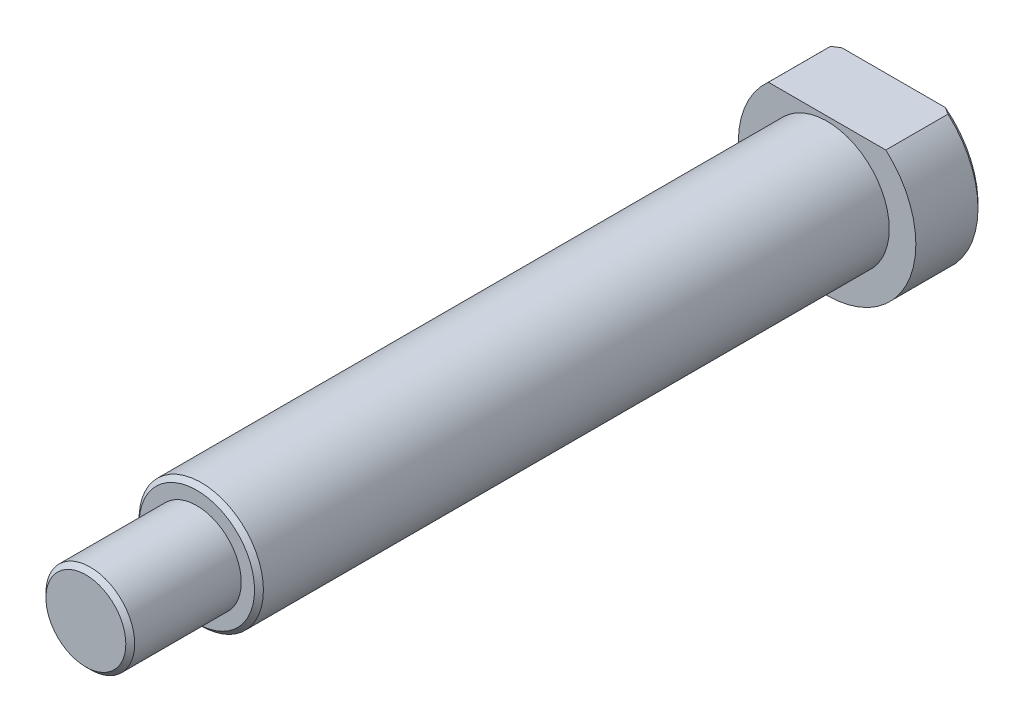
ISO-10303-21;
HEADER;
FILE_DESCRIPTION(('STEP AP214'),'2;1');
FILE_NAME('part.step','',(''),(''),'','','');
FILE_SCHEMA(('AUTOMOTIVE_DESIGN { 1 0 10303 214 1 1 1 1 }'));
ENDSEC;
DATA;
#1=APPLICATION_CONTEXT('core data for automotive mechanical design processes');
#2=APPLICATION_PROTOCOL_DEFINITION('international standard','automotive_design',2000,#1);
#3=PRODUCT_CONTEXT('',#1,'mechanical');
#4=PRODUCT('Part','Part','',(#3));
#5=PRODUCT_RELATED_PRODUCT_CATEGORY('part','',(#4));
#6=PRODUCT_DEFINITION_FORMATION('','',#4);
#7=PRODUCT_DEFINITION_CONTEXT('part definition',#1,'design');
#8=PRODUCT_DEFINITION('design','',#6,#7);
#9=PRODUCT_DEFINITION_SHAPE('','',#8);
#10=(LENGTH_UNIT() NAMED_UNIT(*) SI_UNIT(.MILLI.,.METRE.));
#11=(NAMED_UNIT(*) PLANE_ANGLE_UNIT() SI_UNIT($,.RADIAN.));
#12=(NAMED_UNIT(*) SI_UNIT($,.STERADIAN.) SOLID_ANGLE_UNIT());
#13=UNCERTAINTY_MEASURE_WITH_UNIT(LENGTH_MEASURE(1.E-05),#10,'distance_accuracy_value','');
#14=(GEOMETRIC_REPRESENTATION_CONTEXT(3) GLOBAL_UNCERTAINTY_ASSIGNED_CONTEXT((#13)) GLOBAL_UNIT_ASSIGNED_CONTEXT((#10,
#11,#12)) REPRESENTATION_CONTEXT('',''));
#15=CARTESIAN_POINT('',(0.,0.,0.));
#16=DIRECTION('',(0.,0.,1.));
#17=DIRECTION('',(1.,0.,0.));
#18=AXIS2_PLACEMENT_3D('',#15,#16,#17);
#19=CARTESIAN_POINT('',(0.,0.,157.));
#20=DIRECTION('',(0.,0.,1.));
#21=DIRECTION('',(1.,0.,0.));
#22=AXIS2_PLACEMENT_3D('',#19,#20,#21);
#23=PLANE('',#22);
#24=CARTESIAN_POINT('',(0.,0.,157.));
#25=DIRECTION('',(0.,0.,1.));
#26=DIRECTION('',(1.,0.,0.));
#27=AXIS2_PLACEMENT_3D('',#24,#25,#26);
#28=CIRCLE('',#27,13.);
#29=CARTESIAN_POINT('',(13.,0.,157.));
#30=VERTEX_POINT('',#29);
#31=EDGE_CURVE('E79',#30,#30,#28,.T.);
#32=ORIENTED_EDGE('',*,*,#31,.T.);
#33=EDGE_LOOP('',(#32));
#34=FACE_BOUND('',#33,.T.);
#35=CARTESIAN_POINT('',(0.,0.,157.));
#36=DIRECTION('',(0.,0.,1.));
#37=DIRECTION('',(1.,0.,0.));
#38=AXIS2_PLACEMENT_3D('',#35,#36,#37);
#39=CIRCLE('',#38,10.);
#40=CARTESIAN_POINT('',(10.,0.,157.));
#41=VERTEX_POINT('',#40);
#42=EDGE_CURVE('E146',#41,#41,#39,.T.);
#43=ORIENTED_EDGE('',*,*,#42,.F.);
#44=EDGE_LOOP('',(#43));
#45=FACE_BOUND('',#44,.T.);
#46=ADVANCED_FACE('F30',(#34,#45),#23,.T.);
#47=CARTESIAN_POINT('',(0.,0.,15.));
#48=DIRECTION('',(0.,0.,1.));
#49=DIRECTION('',(1.,0.,0.));
#50=AXIS2_PLACEMENT_3D('',#47,#48,#49);
#51=PLANE('',#50);
#52=CARTESIAN_POINT('',(0.,0.,15.));
#53=DIRECTION('',(0.,0.,1.));
#54=DIRECTION('',(1.,0.,0.));
#55=AXIS2_PLACEMENT_3D('',#52,#53,#54);
#56=CIRCLE('',#55,20.);
#57=CARTESIAN_POINT('',(-13.228756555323,15.,15.));
#58=VERTEX_POINT('',#57);
#59=CARTESIAN_POINT('',(13.228756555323,15.,15.));
#60=VERTEX_POINT('',#59);
#61=EDGE_CURVE('E69',#58,#60,#56,.T.);
#62=ORIENTED_EDGE('',*,*,#61,.T.);
#63=DIRECTION('',(-1.,0.,0.));
#64=VECTOR('',#63,1.);
#65=CARTESIAN_POINT('',(-13.228756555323,15.,15.));
#66=LINE('',#65,#64);
#67=EDGE_CURVE('E60',#60,#58,#66,.T.);
#68=ORIENTED_EDGE('',*,*,#67,.T.);
#69=EDGE_LOOP('',(#62,#68));
#70=FACE_BOUND('',#69,.T.);
#71=CARTESIAN_POINT('',(0.,0.,15.));
#72=DIRECTION('',(0.,0.,1.));
#73=DIRECTION('',(1.,0.,0.));
#74=AXIS2_PLACEMENT_3D('',#71,#72,#73);
#75=CIRCLE('',#74,14.);
#76=CARTESIAN_POINT('',(14.,0.,15.));
#77=VERTEX_POINT('',#76);
#78=EDGE_CURVE('E148',#77,#77,#75,.T.);
#79=ORIENTED_EDGE('',*,*,#78,.F.);
#80=EDGE_LOOP('',(#79));
#81=FACE_BOUND('',#80,.T.);
#82=ADVANCED_FACE('F71',(#70,#81),#51,.T.);
#83=CARTESIAN_POINT('',(0.,0.,15.));
#84=DIRECTION('',(0.,0.,-1.));
#85=DIRECTION('',(-1.,0.,0.));
#86=AXIS2_PLACEMENT_3D('',#83,#84,#85);
#87=CYLINDRICAL_SURFACE('',#86,20.);
#88=DIRECTION('',(0.,0.,-1.));
#89=VECTOR('',#88,1.);
#90=CARTESIAN_POINT('',(-13.228756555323,15.,15.));
#91=LINE('',#90,#89);
#92=CARTESIAN_POINT('',(-13.228756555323,15.,1.));
#93=VERTEX_POINT('',#92);
#94=EDGE_CURVE('E66',#58,#93,#91,.T.);
#95=ORIENTED_EDGE('',*,*,#94,.T.);
#96=CARTESIAN_POINT('',(0.,0.,1.));
#97=DIRECTION('',(0.,0.,1.));
#98=DIRECTION('',(1.,0.,0.));
#99=AXIS2_PLACEMENT_3D('',#96,#97,#98);
#100=CIRCLE('',#99,20.);
#101=CARTESIAN_POINT('',(13.228756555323,15.,1.));
#102=VERTEX_POINT('',#101);
#103=EDGE_CURVE('E78',#93,#102,#100,.T.);
#104=ORIENTED_EDGE('',*,*,#103,.T.);
#105=DIRECTION('',(0.,0.,-1.));
#106=VECTOR('',#105,1.);
#107=CARTESIAN_POINT('',(13.228756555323,15.,15.));
#108=LINE('',#107,#106);
#109=EDGE_CURVE('E64',#60,#102,#108,.T.);
#110=ORIENTED_EDGE('',*,*,#109,.F.);
#111=ORIENTED_EDGE('',*,*,#61,.F.);
#112=EDGE_LOOP('',(#95,#104,#110,#111));
#113=FACE_BOUND('',#112,.T.);
#114=ADVANCED_FACE('F32',(#113),#87,.T.);
#115=CARTESIAN_POINT('',(-13.228756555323,15.,15.));
#116=DIRECTION('',(0.,-1.,0.));
#117=DIRECTION('',(0.,0.,-1.));
#118=AXIS2_PLACEMENT_3D('',#115,#116,#117);
#119=PLANE('',#118);
#120=ORIENTED_EDGE('',*,*,#109,.T.);
#121=CARTESIAN_POINT('',(13.228756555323,15.,1.));
#122=CARTESIAN_POINT('',(13.0995525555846,15.,0.914540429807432));
#123=CARTESIAN_POINT('',(12.9700248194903,15.,0.829569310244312));
#124=CARTESIAN_POINT('',(12.7103026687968,15.,0.660672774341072));
#125=CARTESIAN_POINT('',(12.5801083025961,15.,0.576747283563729));
#126=CARTESIAN_POINT('',(12.3190144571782,15.,0.409998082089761));
#127=CARTESIAN_POINT('',(12.1881149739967,15.,0.327174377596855));
#128=CARTESIAN_POINT('',(11.9255723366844,15.,0.162693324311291));
#129=CARTESIAN_POINT('',(11.7939291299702,15.,0.0810360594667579));
#130=CARTESIAN_POINT('',(11.6619037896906,15.,0.));
#131=B_SPLINE_CURVE_WITH_KNOTS('',3,(#121,#122,#123,#124,#125,#126,#127,#128,#129,#130),
.UNSPECIFIED.,.F.,.F.,(4,2,2,2,4),(0.,0.464728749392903,0.929424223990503,1.39412231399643,
1.85885368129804),.UNSPECIFIED.);
#132=CARTESIAN_POINT('',(11.6619037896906,15.,0.));
#133=VERTEX_POINT('',#132);
#134=EDGE_CURVE('E38',#102,#133,#131,.T.);
#135=ORIENTED_EDGE('',*,*,#134,.T.);
#136=DIRECTION('',(-1.,0.,0.));
#137=VECTOR('',#136,1.);
#138=CARTESIAN_POINT('',(-13.228756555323,15.,0.));
#139=LINE('',#138,#137);
#140=CARTESIAN_POINT('',(-11.6619037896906,15.,0.));
#141=VERTEX_POINT('',#140);
#142=EDGE_CURVE('E74',#133,#141,#139,.T.);
#143=ORIENTED_EDGE('',*,*,#142,.T.);
#144=CARTESIAN_POINT('',(-11.6619037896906,15.,0.));
#145=CARTESIAN_POINT('',(-11.7939291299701,15.,0.0810360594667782));
#146=CARTESIAN_POINT('',(-11.9255723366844,15.,0.162693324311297));
#147=CARTESIAN_POINT('',(-12.1881149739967,15.,0.327174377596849));
#148=CARTESIAN_POINT('',(-12.3190144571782,15.,0.409998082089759));
#149=CARTESIAN_POINT('',(-12.580108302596,15.,0.576747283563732));
#150=CARTESIAN_POINT('',(-12.7103026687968,15.,0.660672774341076));
#151=CARTESIAN_POINT('',(-12.9700248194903,15.,0.829569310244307));
#152=CARTESIAN_POINT('',(-13.0995525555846,15.,0.914540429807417));
#153=CARTESIAN_POINT('',(-13.228756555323,15.,0.999999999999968));
#154=B_SPLINE_CURVE_WITH_KNOTS('',3,(#144,#145,#146,#147,#148,#149,#150,#151,#152,#153),
.UNSPECIFIED.,.F.,.F.,(4,2,2,2,4),(0.,0.464731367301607,0.929429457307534,1.39412493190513,
1.85885368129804),.UNSPECIFIED.);
#155=EDGE_CURVE('E95',#141,#93,#154,.T.);
#156=ORIENTED_EDGE('',*,*,#155,.T.);
#157=ORIENTED_EDGE('',*,*,#94,.F.);
#158=ORIENTED_EDGE('',*,*,#67,.F.);
#159=EDGE_LOOP('',(#120,#135,#143,#156,#157,#158));
#160=FACE_BOUND('',#159,.T.);
#161=ADVANCED_FACE('F62',(#160),#119,.F.);
#162=CARTESIAN_POINT('',(0.,0.,0.));
#163=DIRECTION('',(0.,0.,1.));
#164=DIRECTION('',(1.,0.,0.));
#165=AXIS2_PLACEMENT_3D('',#162,#163,#164);
#166=PLANE('',#165);
#167=ORIENTED_EDGE('',*,*,#142,.F.);
#168=CARTESIAN_POINT('',(0.,0.,0.));
#169=DIRECTION('',(0.,0.,1.));
#170=DIRECTION('',(1.,0.,0.));
#171=AXIS2_PLACEMENT_3D('',#168,#169,#170);
#172=CIRCLE('',#171,19.);
#173=EDGE_CURVE('E11',#133,#141,#172,.F.);
#174=ORIENTED_EDGE('',*,*,#173,.T.);
#175=EDGE_LOOP('',(#167,#174));
#176=FACE_BOUND('',#175,.T.);
#177=ADVANCED_FACE('F109',(#176),#166,.F.);
#178=CARTESIAN_POINT('',(0.,0.,157.));
#179=DIRECTION('',(0.,0.,-1.));
#180=DIRECTION('',(-1.,0.,0.));
#181=AXIS2_PLACEMENT_3D('',#178,#179,#180);
#182=CYLINDRICAL_SURFACE('',#181,14.);
#183=CARTESIAN_POINT('',(0.,0.,156.));
#184=DIRECTION('',(0.,0.,1.));
#185=DIRECTION('',(1.,0.,0.));
#186=AXIS2_PLACEMENT_3D('',#183,#184,#185);
#187=CIRCLE('',#186,14.);
#188=CARTESIAN_POINT('',(14.,0.,156.));
#189=VERTEX_POINT('',#188);
#190=EDGE_CURVE('E82',#189,#189,#187,.F.);
#191=ORIENTED_EDGE('',*,*,#190,.T.);
#192=EDGE_LOOP('',(#191));
#193=FACE_BOUND('',#192,.T.);
#194=ORIENTED_EDGE('',*,*,#78,.T.);
#195=EDGE_LOOP('',(#194));
#196=FACE_BOUND('',#195,.T.);
#197=ADVANCED_FACE('F115',(#193,#196),#182,.T.);
#198=CARTESIAN_POINT('',(0.,0.,182.));
#199=DIRECTION('',(0.,0.,-1.));
#200=DIRECTION('',(-1.,0.,0.));
#201=AXIS2_PLACEMENT_3D('',#198,#199,#200);
#202=CYLINDRICAL_SURFACE('',#201,10.);
#203=CARTESIAN_POINT('',(0.,0.,181.));
#204=DIRECTION('',(0.,0.,1.));
#205=DIRECTION('',(1.,0.,0.));
#206=AXIS2_PLACEMENT_3D('',#203,#204,#205);
#207=CIRCLE('',#206,10.);
#208=CARTESIAN_POINT('',(10.,0.,181.));
#209=VERTEX_POINT('',#208);
#210=EDGE_CURVE('E91',#209,#209,#207,.F.);
#211=ORIENTED_EDGE('',*,*,#210,.T.);
#212=EDGE_LOOP('',(#211));
#213=FACE_BOUND('',#212,.T.);
#214=ORIENTED_EDGE('',*,*,#42,.T.);
#215=EDGE_LOOP('',(#214));
#216=FACE_BOUND('',#215,.T.);
#217=ADVANCED_FACE('F118',(#213,#216),#202,.T.);
#218=CARTESIAN_POINT('',(0.,0.,182.));
#219=DIRECTION('',(0.,0.,1.));
#220=DIRECTION('',(1.,0.,0.));
#221=AXIS2_PLACEMENT_3D('',#218,#219,#220);
#222=PLANE('',#221);
#223=CARTESIAN_POINT('',(0.,0.,182.));
#224=DIRECTION('',(0.,0.,1.));
#225=DIRECTION('',(1.,0.,0.));
#226=AXIS2_PLACEMENT_3D('',#223,#224,#225);
#227=CIRCLE('',#226,9.);
#228=CARTESIAN_POINT('',(9.,0.,182.));
#229=VERTEX_POINT('',#228);
#230=EDGE_CURVE('E88',#229,#229,#227,.T.);
#231=ORIENTED_EDGE('',*,*,#230,.T.);
#232=EDGE_LOOP('',(#231));
#233=FACE_BOUND('',#232,.T.);
#234=ADVANCED_FACE('F125',(#233),#222,.T.);
#235=CARTESIAN_POINT('',(0.,0.,157.));
#236=DIRECTION('',(0.,0.,-1.));
#237=DIRECTION('',(-1.,0.,0.));
#238=AXIS2_PLACEMENT_3D('',#235,#236,#237);
#239=CONICAL_SURFACE('',#238,13.,0.785398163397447);
#240=ORIENTED_EDGE('',*,*,#190,.F.);
#241=EDGE_LOOP('',(#240));
#242=FACE_BOUND('',#241,.T.);
#243=ORIENTED_EDGE('',*,*,#31,.F.);
#244=EDGE_LOOP('',(#243));
#245=FACE_BOUND('',#244,.T.);
#246=ADVANCED_FACE('F129',(#242,#245),#239,.T.);
#247=CARTESIAN_POINT('',(0.,0.,182.));
#248=DIRECTION('',(0.,0.,-1.));
#249=DIRECTION('',(-1.,0.,0.));
#250=AXIS2_PLACEMENT_3D('',#247,#248,#249);
#251=CONICAL_SURFACE('',#250,9.,0.785398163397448);
#252=ORIENTED_EDGE('',*,*,#210,.F.);
#253=EDGE_LOOP('',(#252));
#254=FACE_BOUND('',#253,.T.);
#255=ORIENTED_EDGE('',*,*,#230,.F.);
#256=EDGE_LOOP('',(#255));
#257=FACE_BOUND('',#256,.T.);
#258=ADVANCED_FACE('F132',(#254,#257),#251,.T.);
#259=CARTESIAN_POINT('',(0.,0.,1.));
#260=DIRECTION('',(0.,0.,1.));
#261=DIRECTION('',(1.,0.,0.));
#262=AXIS2_PLACEMENT_3D('',#259,#260,#261);
#263=CONICAL_SURFACE('',#262,20.,0.78539816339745);
#264=ORIENTED_EDGE('',*,*,#155,.F.);
#265=ORIENTED_EDGE('',*,*,#173,.F.);
#266=ORIENTED_EDGE('',*,*,#134,.F.);
#267=ORIENTED_EDGE('',*,*,#103,.F.);
#268=EDGE_LOOP('',(#264,#265,#266,#267));
#269=FACE_BOUND('',#268,.T.);
#270=ADVANCED_FACE('F103',(#269),#263,.T.);
#271=CLOSED_SHELL('',(#46,#82,#114,#161,#177,#197,#217,#234,#246,#258,#270));
#272=MANIFOLD_SOLID_BREP('B2',#271);
#273=ADVANCED_BREP_SHAPE_REPRESENTATION('',(#18,#272),#14);
#274=SHAPE_DEFINITION_REPRESENTATION(#9,#273);
ENDSEC;
END-ISO-10303-21;
